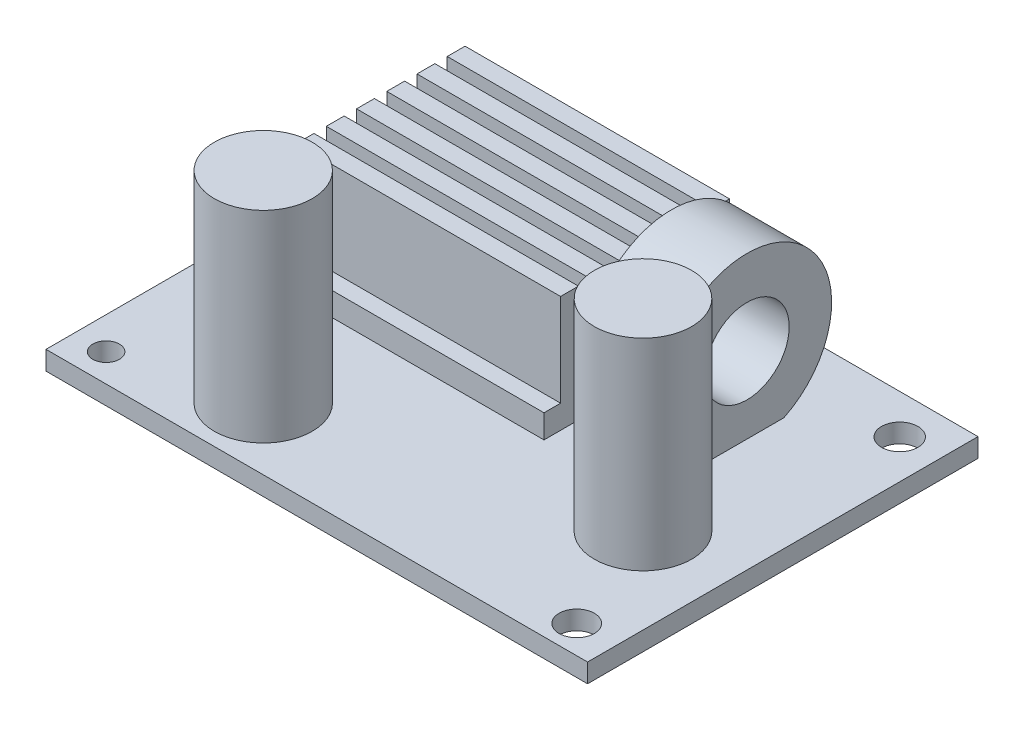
from build123d import *

# Parameters (mm, degrees)
ESQUISSE1_W                = 43
ESQUISSE1_H                = 31
ESQUISSE1_R                = 1.380623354
ESQUISSE1_R_2              = 1.052902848
ESQUISSE1_R_3              = 1.396912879
ESQUISSE1_R_4              = 1.444685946
BOSS_EXTRU_1_DEPTH         = 1.5
ESQUISSE2_R                = 3.865165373
ESQUISSE2_R_2              = 3.885813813
BOSS_EXTRU_2_DEPTH         = 16
BOSS_EXTRU_3_START         = -5
BOSS_EXTRU_3_DEPTH         = 21
R_P_TITION_LIN_AIRE1_COUNT = 6
R_P_TITION_LIN_AIRE1_PITCH = 2.4
BOSS_EXTRU_4_START         = -15
ESQUISSE4_R                = 6.722139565
ESQUISSE4_R_2              = 3.35215002
BOSS_EXTRU_4_DEPTH         = 6


with BuildPart() as part:
    # Esquisse1 → Boss.-Extru.1 (new body)
    with BuildSketch(Plane(origin=(0, 0, 0), x_dir=(1, 0, 0), z_dir=(0, 1, 0))):
        Rectangle(ESQUISSE1_W, ESQUISSE1_H)
        with Locations(Location((-18.952251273, 12.822852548, 0), (0, 0, 270))):
            Circle(ESQUISSE1_R, mode=Mode.SUBTRACT)
        with Locations(Location((-18.952251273, -13.274096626, 0), (0, 0, 270))):
            Circle(ESQUISSE1_R_2, mode=Mode.SUBTRACT)
        with Locations(Location((18.41245661, -13.274096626, 0), (0, 0, 270))):
            Circle(ESQUISSE1_R_3, mode=Mode.SUBTRACT)
        with Locations(Location((18.41245661, 12.37160847, 0), (0, 0, 270))):
            Circle(ESQUISSE1_R_4, mode=Mode.SUBTRACT)
    extrude(amount=BOSS_EXTRU_1_DEPTH)

    # Esquisse2 → Boss.-Extru.2 (add)
    with BuildSketch(Plane(origin=(0, 1.5, 0), x_dir=(1, 0, 0), z_dir=(0, 1, 0))):
        with Locations(Location((14.701577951, -4.301055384, 0), (0, 0, 270))):
            Circle(ESQUISSE2_R)
        with Locations(Location((-9.178649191, -10.571429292, 0), (0, 0, 270))):
            Circle(ESQUISSE2_R_2)
    extrude(amount=BOSS_EXTRU_2_DEPTH)

    # Esquisse3 → Boss.-Extru.3 (add)
    with BuildSketch(Plane.ZY.offset(21.5).offset(BOSS_EXTRU_3_START)):
        Polygon((-12.773434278, 1.5), (-12.773434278, 10.708812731), (-11.357821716, 10.708812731), (-11.357821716, 3.367380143), (-10.040972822, 3.367380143), (-10.040972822, 1.5), align=None)
    boss_extru_3 = extrude(amount=-BOSS_EXTRU_3_DEPTH)

    # R_p_tition lin_aire1: Boss.-Extru.3 ×6
    with Locations(*[(0, 0, i * R_P_TITION_LIN_AIRE1_PITCH) for i in range(1, R_P_TITION_LIN_AIRE1_COUNT)]):
        add(boss_extru_3)

    # Esquisse4 → Boss.-Extru.4 (add)
    with BuildSketch(Plane(origin=(21.5, 0, 0), x_dir=(0, 0, -1), z_dir=(1, 0, 0)).offset(BOSS_EXTRU_4_START)):
        with Locations((6.156268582, 7.548375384)):
            Circle(ESQUISSE4_R)
        with Locations((6.156268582, 7.548375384)):
            Circle(ESQUISSE4_R_2, mode=Mode.SUBTRACT)
    extrude(amount=BOSS_EXTRU_4_DEPTH)


solid = part.part
